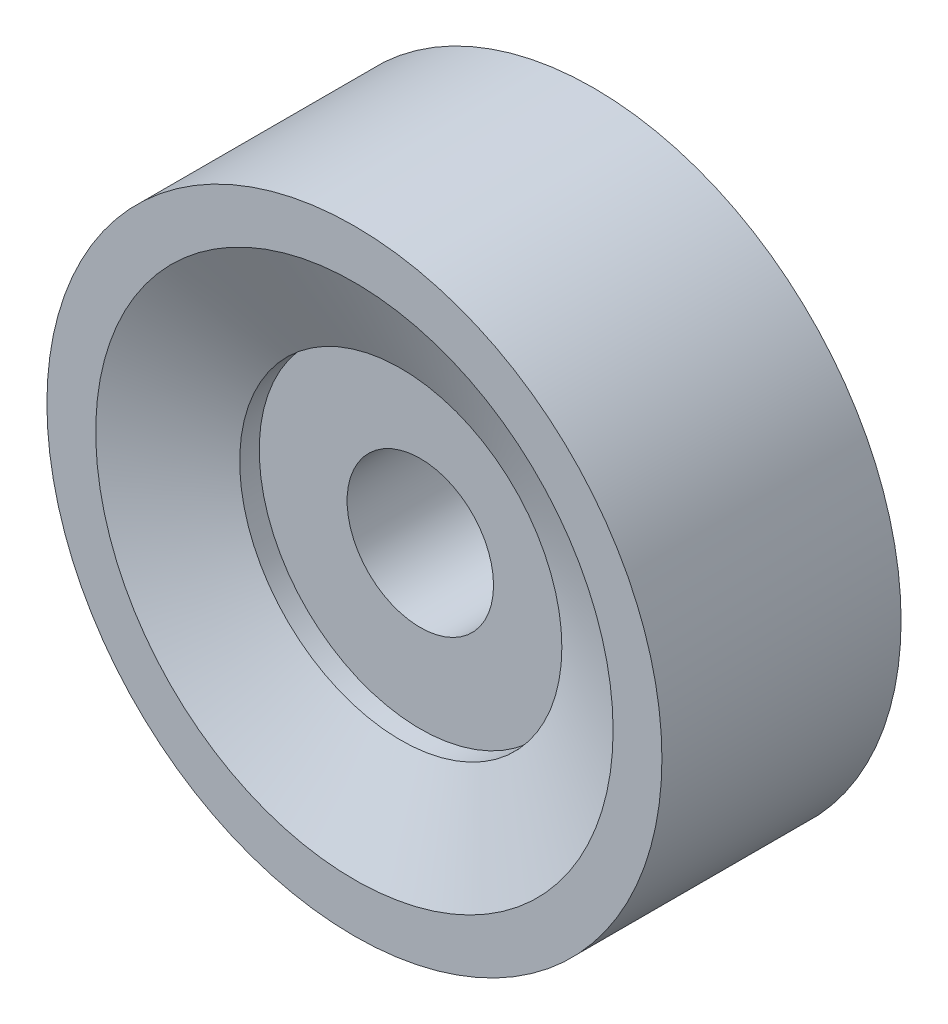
ISO-10303-21;
HEADER;
FILE_DESCRIPTION(('STEP AP214'),'2;1');
FILE_NAME('part.step','',(''),(''),'','','');
FILE_SCHEMA(('AUTOMOTIVE_DESIGN { 1 0 10303 214 1 1 1 1 }'));
ENDSEC;
DATA;
#1=APPLICATION_CONTEXT('core data for automotive mechanical design processes');
#2=APPLICATION_PROTOCOL_DEFINITION('international standard','automotive_design',2000,#1);
#3=PRODUCT_CONTEXT('',#1,'mechanical');
#4=PRODUCT('Part','Part','',(#3));
#5=PRODUCT_RELATED_PRODUCT_CATEGORY('part','',(#4));
#6=PRODUCT_DEFINITION_FORMATION('','',#4);
#7=PRODUCT_DEFINITION_CONTEXT('part definition',#1,'design');
#8=PRODUCT_DEFINITION('design','',#6,#7);
#9=PRODUCT_DEFINITION_SHAPE('','',#8);
#10=(LENGTH_UNIT() NAMED_UNIT(*) SI_UNIT(.MILLI.,.METRE.));
#11=(NAMED_UNIT(*) PLANE_ANGLE_UNIT() SI_UNIT($,.RADIAN.));
#12=(NAMED_UNIT(*) SI_UNIT($,.STERADIAN.) SOLID_ANGLE_UNIT());
#13=UNCERTAINTY_MEASURE_WITH_UNIT(LENGTH_MEASURE(1.E-05),#10,'distance_accuracy_value','');
#14=(GEOMETRIC_REPRESENTATION_CONTEXT(3) GLOBAL_UNCERTAINTY_ASSIGNED_CONTEXT((#13)) GLOBAL_UNIT_ASSIGNED_CONTEXT((#10,
#11,#12)) REPRESENTATION_CONTEXT('',''));
#15=CARTESIAN_POINT('',(0.,0.,0.));
#16=DIRECTION('',(0.,0.,1.));
#17=DIRECTION('',(1.,0.,0.));
#18=AXIS2_PLACEMENT_3D('',#15,#16,#17);
#19=CARTESIAN_POINT('',(0.,-37.5,12.25));
#20=DIRECTION('',(0.,0.,1.));
#21=DIRECTION('',(-1.,0.,0.));
#22=AXIS2_PLACEMENT_3D('',#19,#20,#21);
#23=PLANE('',#22);
#24=CARTESIAN_POINT('',(0.,0.,12.25));
#25=DIRECTION('',(0.,0.,-1.));
#26=DIRECTION('',(1.,0.,0.));
#27=AXIS2_PLACEMENT_3D('',#24,#25,#26);
#28=CIRCLE('',#27,26.5);
#29=CARTESIAN_POINT('',(26.5,0.,12.25));
#30=VERTEX_POINT('',#29);
#31=EDGE_CURVE('E32',#30,#30,#28,.T.);
#32=ORIENTED_EDGE('',*,*,#31,.T.);
#33=EDGE_LOOP('',(#32));
#34=FACE_BOUND('',#33,.T.);
#35=CARTESIAN_POINT('',(0.,0.,12.25));
#36=DIRECTION('',(0.,0.,1.));
#37=DIRECTION('',(1.,0.,0.));
#38=AXIS2_PLACEMENT_3D('',#35,#36,#37);
#39=CIRCLE('',#38,31.5);
#40=CARTESIAN_POINT('',(31.5,0.,12.25));
#41=VERTEX_POINT('',#40);
#42=EDGE_CURVE('E45',#41,#41,#39,.T.);
#43=ORIENTED_EDGE('',*,*,#42,.T.);
#44=EDGE_LOOP('',(#43));
#45=FACE_BOUND('',#44,.T.);
#46=ADVANCED_FACE('F12',(#34,#45),#23,.T.);
#47=CARTESIAN_POINT('',(0.,-37.5,-12.25));
#48=DIRECTION('',(0.,0.,1.));
#49=DIRECTION('',(-1.,0.,0.));
#50=AXIS2_PLACEMENT_3D('',#47,#48,#49);
#51=PLANE('',#50);
#52=CARTESIAN_POINT('',(0.,0.,-12.25));
#53=DIRECTION('',(0.,0.,-1.));
#54=DIRECTION('',(1.,0.,0.));
#55=AXIS2_PLACEMENT_3D('',#52,#53,#54);
#56=CIRCLE('',#55,26.5);
#57=CARTESIAN_POINT('',(26.5,0.,-12.25));
#58=VERTEX_POINT('',#57);
#59=EDGE_CURVE('E35',#58,#58,#56,.T.);
#60=ORIENTED_EDGE('',*,*,#59,.F.);
#61=EDGE_LOOP('',(#60));
#62=FACE_BOUND('',#61,.T.);
#63=CARTESIAN_POINT('',(0.,0.,-12.25));
#64=DIRECTION('',(0.,0.,1.));
#65=DIRECTION('',(1.,0.,0.));
#66=AXIS2_PLACEMENT_3D('',#63,#64,#65);
#67=CIRCLE('',#66,31.5);
#68=CARTESIAN_POINT('',(31.5,0.,-12.25));
#69=VERTEX_POINT('',#68);
#70=EDGE_CURVE('E44',#69,#69,#67,.T.);
#71=ORIENTED_EDGE('',*,*,#70,.F.);
#72=EDGE_LOOP('',(#71));
#73=FACE_BOUND('',#72,.T.);
#74=ADVANCED_FACE('F54',(#62,#73),#51,.F.);
#75=CARTESIAN_POINT('',(0.,-7.5,-5.5));
#76=DIRECTION('',(0.,0.,-1.));
#77=DIRECTION('',(1.,0.,0.));
#78=AXIS2_PLACEMENT_3D('',#75,#76,#77);
#79=PLANE('',#78);
#80=CARTESIAN_POINT('',(0.,0.,-5.5));
#81=DIRECTION('',(0.,0.,-1.));
#82=DIRECTION('',(1.,0.,0.));
#83=AXIS2_PLACEMENT_3D('',#80,#81,#82);
#84=CIRCLE('',#83,16.5);
#85=CARTESIAN_POINT('',(16.5,0.,-5.5));
#86=VERTEX_POINT('',#85);
#87=EDGE_CURVE('E41',#86,#86,#84,.T.);
#88=ORIENTED_EDGE('',*,*,#87,.T.);
#89=EDGE_LOOP('',(#88));
#90=FACE_BOUND('',#89,.T.);
#91=CARTESIAN_POINT('',(0.,0.,-5.5));
#92=DIRECTION('',(0.,0.,-1.));
#93=DIRECTION('',(1.,0.,0.));
#94=AXIS2_PLACEMENT_3D('',#91,#92,#93);
#95=CIRCLE('',#94,7.5);
#96=CARTESIAN_POINT('',(7.5,0.,-5.5));
#97=VERTEX_POINT('',#96);
#98=EDGE_CURVE('E8',#97,#97,#95,.T.);
#99=ORIENTED_EDGE('',*,*,#98,.F.);
#100=EDGE_LOOP('',(#99));
#101=FACE_BOUND('',#100,.T.);
#102=ADVANCED_FACE('F14',(#90,#101),#79,.T.);
#103=CARTESIAN_POINT('',(0.,0.,-20.));
#104=DIRECTION('',(0.,0.,-1.));
#105=DIRECTION('',(1.,0.,0.));
#106=AXIS2_PLACEMENT_3D('',#103,#104,#105);
#107=CYLINDRICAL_SURFACE('',#106,7.5);
#108=ORIENTED_EDGE('',*,*,#98,.T.);
#109=EDGE_LOOP('',(#108));
#110=FACE_BOUND('',#109,.T.);
#111=CARTESIAN_POINT('',(0.,0.,5.5));
#112=DIRECTION('',(0.,0.,-1.));
#113=DIRECTION('',(1.,0.,0.));
#114=AXIS2_PLACEMENT_3D('',#111,#112,#113);
#115=CIRCLE('',#114,7.5);
#116=CARTESIAN_POINT('',(7.5,0.,5.5));
#117=VERTEX_POINT('',#116);
#118=EDGE_CURVE('E19',#117,#117,#115,.T.);
#119=ORIENTED_EDGE('',*,*,#118,.F.);
#120=EDGE_LOOP('',(#119));
#121=FACE_BOUND('',#120,.T.);
#122=ADVANCED_FACE('F64',(#110,#121),#107,.F.);
#123=CARTESIAN_POINT('',(0.,-7.5,5.5));
#124=DIRECTION('',(0.,0.,-1.));
#125=DIRECTION('',(1.,0.,0.));
#126=AXIS2_PLACEMENT_3D('',#123,#124,#125);
#127=PLANE('',#126);
#128=CARTESIAN_POINT('',(0.,0.,5.5));
#129=DIRECTION('',(0.,0.,-1.));
#130=DIRECTION('',(1.,0.,0.));
#131=AXIS2_PLACEMENT_3D('',#128,#129,#130);
#132=CIRCLE('',#131,16.5);
#133=CARTESIAN_POINT('',(16.5,0.,5.5));
#134=VERTEX_POINT('',#133);
#135=EDGE_CURVE('E23',#134,#134,#132,.T.);
#136=ORIENTED_EDGE('',*,*,#135,.F.);
#137=EDGE_LOOP('',(#136));
#138=FACE_BOUND('',#137,.T.);
#139=ORIENTED_EDGE('',*,*,#118,.T.);
#140=EDGE_LOOP('',(#139));
#141=FACE_BOUND('',#140,.T.);
#142=ADVANCED_FACE('F80',(#138,#141),#127,.F.);
#143=CARTESIAN_POINT('',(0.,0.,-20.));
#144=DIRECTION('',(0.,0.,-1.));
#145=DIRECTION('',(1.,0.,0.));
#146=AXIS2_PLACEMENT_3D('',#143,#144,#145);
#147=CYLINDRICAL_SURFACE('',#146,16.5);
#148=CARTESIAN_POINT('',(0.,0.,7.5));
#149=DIRECTION('',(0.,0.,-1.));
#150=DIRECTION('',(1.,0.,0.));
#151=AXIS2_PLACEMENT_3D('',#148,#149,#150);
#152=CIRCLE('',#151,16.5);
#153=CARTESIAN_POINT('',(16.5,0.,7.5));
#154=VERTEX_POINT('',#153);
#155=EDGE_CURVE('E27',#154,#154,#152,.T.);
#156=ORIENTED_EDGE('',*,*,#155,.F.);
#157=EDGE_LOOP('',(#156));
#158=FACE_BOUND('',#157,.T.);
#159=ORIENTED_EDGE('',*,*,#135,.T.);
#160=EDGE_LOOP('',(#159));
#161=FACE_BOUND('',#160,.T.);
#162=ADVANCED_FACE('F76',(#158,#161),#147,.F.);
#163=CARTESIAN_POINT('',(0.,0.,7.5));
#164=DIRECTION('',(0.,0.,1.));
#165=DIRECTION('',(-1.,0.,0.));
#166=AXIS2_PLACEMENT_3D('',#163,#164,#165);
#167=CONICAL_SURFACE('',#166,16.5,1.12734799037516);
#168=ORIENTED_EDGE('',*,*,#31,.F.);
#169=EDGE_LOOP('',(#168));
#170=FACE_BOUND('',#169,.T.);
#171=ORIENTED_EDGE('',*,*,#155,.T.);
#172=EDGE_LOOP('',(#171));
#173=FACE_BOUND('',#172,.T.);
#174=ADVANCED_FACE('F73',(#170,#173),#167,.F.);
#175=CARTESIAN_POINT('',(0.,0.,-7.5));
#176=DIRECTION('',(0.,0.,-1.));
#177=DIRECTION('',(1.,0.,0.));
#178=AXIS2_PLACEMENT_3D('',#175,#176,#177);
#179=CONICAL_SURFACE('',#178,16.5,1.12734799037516);
#180=ORIENTED_EDGE('',*,*,#59,.T.);
#181=EDGE_LOOP('',(#180));
#182=FACE_BOUND('',#181,.T.);
#183=CARTESIAN_POINT('',(0.,0.,-7.5));
#184=DIRECTION('',(0.,0.,-1.));
#185=DIRECTION('',(1.,0.,0.));
#186=AXIS2_PLACEMENT_3D('',#183,#184,#185);
#187=CIRCLE('',#186,16.5);
#188=CARTESIAN_POINT('',(16.5,0.,-7.5));
#189=VERTEX_POINT('',#188);
#190=EDGE_CURVE('E38',#189,#189,#187,.T.);
#191=ORIENTED_EDGE('',*,*,#190,.F.);
#192=EDGE_LOOP('',(#191));
#193=FACE_BOUND('',#192,.T.);
#194=ADVANCED_FACE('F70',(#182,#193),#179,.F.);
#195=CARTESIAN_POINT('',(0.,0.,-20.));
#196=DIRECTION('',(0.,0.,-1.));
#197=DIRECTION('',(1.,0.,0.));
#198=AXIS2_PLACEMENT_3D('',#195,#196,#197);
#199=CYLINDRICAL_SURFACE('',#198,16.5);
#200=ORIENTED_EDGE('',*,*,#190,.T.);
#201=EDGE_LOOP('',(#200));
#202=FACE_BOUND('',#201,.T.);
#203=ORIENTED_EDGE('',*,*,#87,.F.);
#204=EDGE_LOOP('',(#203));
#205=FACE_BOUND('',#204,.T.);
#206=ADVANCED_FACE('F118',(#202,#205),#199,.F.);
#207=CARTESIAN_POINT('',(0.,0.,-12.25));
#208=DIRECTION('',(0.,0.,1.));
#209=DIRECTION('',(1.,0.,0.));
#210=AXIS2_PLACEMENT_3D('',#207,#208,#209);
#211=CYLINDRICAL_SURFACE('',#210,31.5);
#212=ORIENTED_EDGE('',*,*,#70,.T.);
#213=EDGE_LOOP('',(#212));
#214=FACE_BOUND('',#213,.T.);
#215=ORIENTED_EDGE('',*,*,#42,.F.);
#216=EDGE_LOOP('',(#215));
#217=FACE_BOUND('',#216,.T.);
#218=ADVANCED_FACE('F51',(#214,#217),#211,.T.);
#219=CLOSED_SHELL('',(#46,#74,#102,#122,#142,#162,#174,#194,#206,#218));
#220=MANIFOLD_SOLID_BREP('B1',#219);
#221=ADVANCED_BREP_SHAPE_REPRESENTATION('',(#18,#220),#14);
#222=SHAPE_DEFINITION_REPRESENTATION(#9,#221);
ENDSEC;
END-ISO-10303-21;
